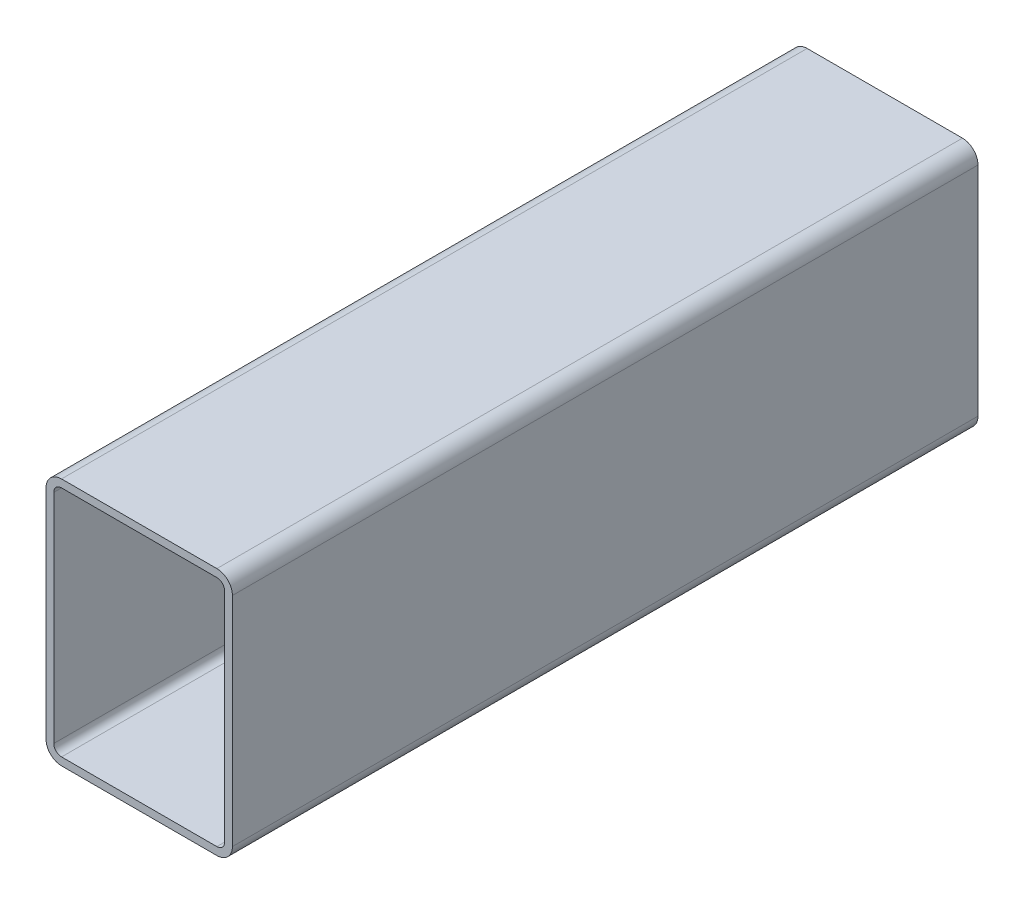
ISO-10303-21;
HEADER;
FILE_DESCRIPTION(('STEP AP214'),'2;1');
FILE_NAME('part.step','',(''),(''),'','','');
FILE_SCHEMA(('AUTOMOTIVE_DESIGN { 1 0 10303 214 1 1 1 1 }'));
ENDSEC;
DATA;
#1=APPLICATION_CONTEXT('core data for automotive mechanical design processes');
#2=APPLICATION_PROTOCOL_DEFINITION('international standard','automotive_design',2000,#1);
#3=PRODUCT_CONTEXT('',#1,'mechanical');
#4=PRODUCT('Part','Part','',(#3));
#5=PRODUCT_RELATED_PRODUCT_CATEGORY('part','',(#4));
#6=PRODUCT_DEFINITION_FORMATION('','',#4);
#7=PRODUCT_DEFINITION_CONTEXT('part definition',#1,'design');
#8=PRODUCT_DEFINITION('design','',#6,#7);
#9=PRODUCT_DEFINITION_SHAPE('','',#8);
#10=(LENGTH_UNIT() NAMED_UNIT(*) SI_UNIT(.MILLI.,.METRE.));
#11=(NAMED_UNIT(*) PLANE_ANGLE_UNIT() SI_UNIT($,.RADIAN.));
#12=(NAMED_UNIT(*) SI_UNIT($,.STERADIAN.) SOLID_ANGLE_UNIT());
#13=UNCERTAINTY_MEASURE_WITH_UNIT(LENGTH_MEASURE(1.E-05),#10,'distance_accuracy_value','');
#14=(GEOMETRIC_REPRESENTATION_CONTEXT(3) GLOBAL_UNCERTAINTY_ASSIGNED_CONTEXT((#13)) GLOBAL_UNIT_ASSIGNED_CONTEXT((#10,
#11,#12)) REPRESENTATION_CONTEXT('',''));
#15=CARTESIAN_POINT('',(0.,0.,0.));
#16=DIRECTION('',(0.,0.,1.));
#17=DIRECTION('',(1.,0.,0.));
#18=AXIS2_PLACEMENT_3D('',#15,#16,#17);
#19=CARTESIAN_POINT('',(8.83911603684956,97.3077651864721,304.8));
#20=DIRECTION('',(0.,0.,1.));
#21=DIRECTION('',(1.,0.,0.));
#22=AXIS2_PLACEMENT_3D('',#19,#20,#21);
#23=PLANE('',#22);
#24=CARTESIAN_POINT('',(8.83911603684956,97.3077651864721,304.8));
#25=DIRECTION('',(0.,0.,1.));
#26=DIRECTION('',(1.,0.,0.));
#27=AXIS2_PLACEMENT_3D('',#24,#25,#26);
#28=CIRCLE('',#27,6.35000000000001);
#29=CARTESIAN_POINT('',(8.83911603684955,103.657765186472,304.8));
#30=VERTEX_POINT('',#29);
#31=CARTESIAN_POINT('',(2.48911603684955,97.3077651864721,304.8));
#32=VERTEX_POINT('',#31);
#33=EDGE_CURVE('E211',#30,#32,#28,.T.);
#34=ORIENTED_EDGE('',*,*,#33,.T.);
#35=DIRECTION('',(0.,-1.,0.));
#36=VECTOR('',#35,1.);
#37=CARTESIAN_POINT('',(2.48911603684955,8.40776518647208,304.8));
#38=LINE('',#37,#36);
#39=CARTESIAN_POINT('',(2.48911603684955,8.40776518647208,304.8));
#40=VERTEX_POINT('',#39);
#41=EDGE_CURVE('E214',#32,#40,#38,.T.);
#42=ORIENTED_EDGE('',*,*,#41,.T.);
#43=CARTESIAN_POINT('',(8.83911603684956,8.40776518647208,304.8));
#44=DIRECTION('',(0.,0.,1.));
#45=DIRECTION('',(1.,0.,0.));
#46=AXIS2_PLACEMENT_3D('',#43,#44,#45);
#47=CIRCLE('',#46,6.35);
#48=CARTESIAN_POINT('',(8.83911603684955,2.05776518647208,304.8));
#49=VERTEX_POINT('',#48);
#50=EDGE_CURVE('E217',#40,#49,#47,.T.);
#51=ORIENTED_EDGE('',*,*,#50,.T.);
#52=DIRECTION('',(1.,0.,0.));
#53=VECTOR('',#52,1.);
#54=CARTESIAN_POINT('',(72.3391160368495,2.05776518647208,304.8));
#55=LINE('',#54,#53);
#56=CARTESIAN_POINT('',(72.3391160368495,2.05776518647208,304.8));
#57=VERTEX_POINT('',#56);
#58=EDGE_CURVE('E219',#49,#57,#55,.T.);
#59=ORIENTED_EDGE('',*,*,#58,.T.);
#60=CARTESIAN_POINT('',(72.3391160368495,8.40776518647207,304.8));
#61=DIRECTION('',(0.,0.,1.));
#62=DIRECTION('',(1.,0.,0.));
#63=AXIS2_PLACEMENT_3D('',#60,#61,#62);
#64=CIRCLE('',#63,6.35);
#65=CARTESIAN_POINT('',(78.6891160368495,8.40776518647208,304.8));
#66=VERTEX_POINT('',#65);
#67=EDGE_CURVE('E221',#57,#66,#64,.T.);
#68=ORIENTED_EDGE('',*,*,#67,.T.);
#69=DIRECTION('',(0.,1.,0.));
#70=VECTOR('',#69,1.);
#71=CARTESIAN_POINT('',(78.6891160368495,97.3077651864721,304.8));
#72=LINE('',#71,#70);
#73=CARTESIAN_POINT('',(78.6891160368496,97.3077651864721,304.8));
#74=VERTEX_POINT('',#73);
#75=EDGE_CURVE('E223',#66,#74,#72,.T.);
#76=ORIENTED_EDGE('',*,*,#75,.T.);
#77=CARTESIAN_POINT('',(72.3391160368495,97.3077651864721,304.8));
#78=DIRECTION('',(0.,0.,1.));
#79=DIRECTION('',(1.,0.,0.));
#80=AXIS2_PLACEMENT_3D('',#77,#78,#79);
#81=CIRCLE('',#80,6.35);
#82=CARTESIAN_POINT('',(72.3391160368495,103.657765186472,304.8));
#83=VERTEX_POINT('',#82);
#84=EDGE_CURVE('E225',#74,#83,#81,.T.);
#85=ORIENTED_EDGE('',*,*,#84,.T.);
#86=DIRECTION('',(-1.,0.,0.));
#87=VECTOR('',#86,1.);
#88=CARTESIAN_POINT('',(8.83911603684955,103.657765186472,304.8));
#89=LINE('',#88,#87);
#90=EDGE_CURVE('E227',#83,#30,#89,.T.);
#91=ORIENTED_EDGE('',*,*,#90,.T.);
#92=EDGE_LOOP('',(#34,#42,#51,#59,#68,#76,#85,#91));
#93=FACE_BOUND('',#92,.T.);
#94=DIRECTION('',(0.,-1.,0.));
#95=VECTOR('',#94,1.);
#96=CARTESIAN_POINT('',(5.66411603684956,8.40776518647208,304.8));
#97=LINE('',#96,#95);
#98=CARTESIAN_POINT('',(5.66411603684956,97.3077651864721,304.8));
#99=VERTEX_POINT('',#98);
#100=CARTESIAN_POINT('',(5.66411603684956,8.40776518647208,304.8));
#101=VERTEX_POINT('',#100);
#102=EDGE_CURVE('E154',#99,#101,#97,.T.);
#103=ORIENTED_EDGE('',*,*,#102,.F.);
#104=CARTESIAN_POINT('',(8.83911603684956,97.3077651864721,304.8));
#105=DIRECTION('',(0.,0.,1.));
#106=DIRECTION('',(1.,0.,0.));
#107=AXIS2_PLACEMENT_3D('',#104,#105,#106);
#108=CIRCLE('',#107,3.17500000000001);
#109=CARTESIAN_POINT('',(8.83911603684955,100.482765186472,304.8));
#110=VERTEX_POINT('',#109);
#111=EDGE_CURVE('E146',#110,#99,#108,.T.);
#112=ORIENTED_EDGE('',*,*,#111,.F.);
#113=DIRECTION('',(-1.,0.,0.));
#114=VECTOR('',#113,1.);
#115=CARTESIAN_POINT('',(8.83911603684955,100.482765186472,304.8));
#116=LINE('',#115,#114);
#117=CARTESIAN_POINT('',(72.3391160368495,100.482765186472,304.8));
#118=VERTEX_POINT('',#117);
#119=EDGE_CURVE('E179',#118,#110,#116,.T.);
#120=ORIENTED_EDGE('',*,*,#119,.F.);
#121=CARTESIAN_POINT('',(72.3391160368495,97.3077651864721,304.8));
#122=DIRECTION('',(0.,0.,1.));
#123=DIRECTION('',(1.,0.,0.));
#124=AXIS2_PLACEMENT_3D('',#121,#122,#123);
#125=CIRCLE('',#124,3.17500000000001);
#126=CARTESIAN_POINT('',(75.5141160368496,97.3077651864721,304.8));
#127=VERTEX_POINT('',#126);
#128=EDGE_CURVE('E177',#127,#118,#125,.T.);
#129=ORIENTED_EDGE('',*,*,#128,.F.);
#130=DIRECTION('',(0.,1.,0.));
#131=VECTOR('',#130,1.);
#132=CARTESIAN_POINT('',(75.5141160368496,97.3077651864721,304.8));
#133=LINE('',#132,#131);
#134=CARTESIAN_POINT('',(75.5141160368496,8.40776518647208,304.8));
#135=VERTEX_POINT('',#134);
#136=EDGE_CURVE('E175',#135,#127,#133,.T.);
#137=ORIENTED_EDGE('',*,*,#136,.F.);
#138=CARTESIAN_POINT('',(72.3391160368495,8.40776518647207,304.8));
#139=DIRECTION('',(0.,0.,1.));
#140=DIRECTION('',(1.,0.,0.));
#141=AXIS2_PLACEMENT_3D('',#138,#139,#140);
#142=CIRCLE('',#141,3.175);
#143=CARTESIAN_POINT('',(72.3391160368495,5.23276518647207,304.8));
#144=VERTEX_POINT('',#143);
#145=EDGE_CURVE('E173',#144,#135,#142,.T.);
#146=ORIENTED_EDGE('',*,*,#145,.F.);
#147=DIRECTION('',(1.,0.,0.));
#148=VECTOR('',#147,1.);
#149=CARTESIAN_POINT('',(72.3391160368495,5.23276518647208,304.8));
#150=LINE('',#149,#148);
#151=CARTESIAN_POINT('',(8.83911603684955,5.23276518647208,304.8));
#152=VERTEX_POINT('',#151);
#153=EDGE_CURVE('E169',#152,#144,#150,.T.);
#154=ORIENTED_EDGE('',*,*,#153,.F.);
#155=CARTESIAN_POINT('',(8.83911603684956,8.40776518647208,304.8));
#156=DIRECTION('',(0.,0.,1.));
#157=DIRECTION('',(1.,0.,0.));
#158=AXIS2_PLACEMENT_3D('',#155,#156,#157);
#159=CIRCLE('',#158,3.175);
#160=EDGE_CURVE('E167',#101,#152,#159,.T.);
#161=ORIENTED_EDGE('',*,*,#160,.F.);
#162=EDGE_LOOP('',(#103,#112,#120,#129,#137,#146,#154,#161));
#163=FACE_BOUND('',#162,.T.);
#164=ADVANCED_FACE('F33',(#93,#163),#23,.T.);
#165=CARTESIAN_POINT('',(8.83911603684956,97.3077651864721,0.));
#166=DIRECTION('',(0.,0.,1.));
#167=DIRECTION('',(1.,0.,0.));
#168=AXIS2_PLACEMENT_3D('',#165,#166,#167);
#169=PLANE('',#168);
#170=CARTESIAN_POINT('',(8.83911603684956,97.3077651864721,0.));
#171=DIRECTION('',(0.,0.,1.));
#172=DIRECTION('',(1.,0.,0.));
#173=AXIS2_PLACEMENT_3D('',#170,#171,#172);
#174=CIRCLE('',#173,6.35000000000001);
#175=CARTESIAN_POINT('',(8.83911603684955,103.657765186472,0.));
#176=VERTEX_POINT('',#175);
#177=CARTESIAN_POINT('',(2.48911603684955,97.3077651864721,0.));
#178=VERTEX_POINT('',#177);
#179=EDGE_CURVE('E162',#176,#178,#174,.T.);
#180=ORIENTED_EDGE('',*,*,#179,.F.);
#181=DIRECTION('',(-1.,0.,0.));
#182=VECTOR('',#181,1.);
#183=CARTESIAN_POINT('',(8.83911603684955,103.657765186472,0.));
#184=LINE('',#183,#182);
#185=CARTESIAN_POINT('',(72.3391160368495,103.657765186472,0.));
#186=VERTEX_POINT('',#185);
#187=EDGE_CURVE('E215',#186,#176,#184,.T.);
#188=ORIENTED_EDGE('',*,*,#187,.F.);
#189=CARTESIAN_POINT('',(72.3391160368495,97.3077651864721,0.));
#190=DIRECTION('',(0.,0.,1.));
#191=DIRECTION('',(1.,0.,0.));
#192=AXIS2_PLACEMENT_3D('',#189,#190,#191);
#193=CIRCLE('',#192,6.35);
#194=CARTESIAN_POINT('',(78.6891160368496,97.3077651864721,0.));
#195=VERTEX_POINT('',#194);
#196=EDGE_CURVE('E242',#195,#186,#193,.T.);
#197=ORIENTED_EDGE('',*,*,#196,.F.);
#198=DIRECTION('',(0.,1.,0.));
#199=VECTOR('',#198,1.);
#200=CARTESIAN_POINT('',(78.6891160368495,97.3077651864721,0.));
#201=LINE('',#200,#199);
#202=CARTESIAN_POINT('',(78.6891160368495,8.40776518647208,0.));
#203=VERTEX_POINT('',#202);
#204=EDGE_CURVE('E240',#203,#195,#201,.T.);
#205=ORIENTED_EDGE('',*,*,#204,.F.);
#206=CARTESIAN_POINT('',(72.3391160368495,8.40776518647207,0.));
#207=DIRECTION('',(0.,0.,1.));
#208=DIRECTION('',(1.,0.,0.));
#209=AXIS2_PLACEMENT_3D('',#206,#207,#208);
#210=CIRCLE('',#209,6.35);
#211=CARTESIAN_POINT('',(72.3391160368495,2.05776518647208,0.));
#212=VERTEX_POINT('',#211);
#213=EDGE_CURVE('E238',#212,#203,#210,.T.);
#214=ORIENTED_EDGE('',*,*,#213,.F.);
#215=DIRECTION('',(1.,0.,0.));
#216=VECTOR('',#215,1.);
#217=CARTESIAN_POINT('',(72.3391160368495,2.05776518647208,0.));
#218=LINE('',#217,#216);
#219=CARTESIAN_POINT('',(8.83911603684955,2.05776518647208,0.));
#220=VERTEX_POINT('',#219);
#221=EDGE_CURVE('E236',#220,#212,#218,.T.);
#222=ORIENTED_EDGE('',*,*,#221,.F.);
#223=CARTESIAN_POINT('',(8.83911603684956,8.40776518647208,0.));
#224=DIRECTION('',(0.,0.,1.));
#225=DIRECTION('',(1.,0.,0.));
#226=AXIS2_PLACEMENT_3D('',#223,#224,#225);
#227=CIRCLE('',#226,6.35);
#228=CARTESIAN_POINT('',(2.48911603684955,8.40776518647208,0.));
#229=VERTEX_POINT('',#228);
#230=EDGE_CURVE('E234',#229,#220,#227,.T.);
#231=ORIENTED_EDGE('',*,*,#230,.F.);
#232=DIRECTION('',(0.,-1.,0.));
#233=VECTOR('',#232,1.);
#234=CARTESIAN_POINT('',(2.48911603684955,8.40776518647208,0.));
#235=LINE('',#234,#233);
#236=EDGE_CURVE('E232',#178,#229,#235,.T.);
#237=ORIENTED_EDGE('',*,*,#236,.F.);
#238=EDGE_LOOP('',(#180,#188,#197,#205,#214,#222,#231,#237));
#239=FACE_BOUND('',#238,.T.);
#240=CARTESIAN_POINT('',(8.83911603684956,97.3077651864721,0.));
#241=DIRECTION('',(0.,0.,1.));
#242=DIRECTION('',(1.,0.,0.));
#243=AXIS2_PLACEMENT_3D('',#240,#241,#242);
#244=CIRCLE('',#243,3.17500000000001);
#245=CARTESIAN_POINT('',(8.83911603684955,100.482765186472,0.));
#246=VERTEX_POINT('',#245);
#247=CARTESIAN_POINT('',(5.66411603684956,97.3077651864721,0.));
#248=VERTEX_POINT('',#247);
#249=EDGE_CURVE('E56',#246,#248,#244,.T.);
#250=ORIENTED_EDGE('',*,*,#249,.T.);
#251=DIRECTION('',(0.,-1.,0.));
#252=VECTOR('',#251,1.);
#253=CARTESIAN_POINT('',(5.66411603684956,8.40776518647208,0.));
#254=LINE('',#253,#252);
#255=CARTESIAN_POINT('',(5.66411603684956,8.40776518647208,0.));
#256=VERTEX_POINT('',#255);
#257=EDGE_CURVE('E161',#248,#256,#254,.T.);
#258=ORIENTED_EDGE('',*,*,#257,.T.);
#259=CARTESIAN_POINT('',(8.83911603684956,8.40776518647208,0.));
#260=DIRECTION('',(0.,0.,1.));
#261=DIRECTION('',(1.,0.,0.));
#262=AXIS2_PLACEMENT_3D('',#259,#260,#261);
#263=CIRCLE('',#262,3.175);
#264=CARTESIAN_POINT('',(8.83911603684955,5.23276518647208,0.));
#265=VERTEX_POINT('',#264);
#266=EDGE_CURVE('E183',#256,#265,#263,.T.);
#267=ORIENTED_EDGE('',*,*,#266,.T.);
#268=DIRECTION('',(1.,0.,0.));
#269=VECTOR('',#268,1.);
#270=CARTESIAN_POINT('',(72.3391160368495,5.23276518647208,0.));
#271=LINE('',#270,#269);
#272=CARTESIAN_POINT('',(72.3391160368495,5.23276518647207,0.));
#273=VERTEX_POINT('',#272);
#274=EDGE_CURVE('E186',#265,#273,#271,.T.);
#275=ORIENTED_EDGE('',*,*,#274,.T.);
#276=CARTESIAN_POINT('',(72.3391160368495,8.40776518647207,0.));
#277=DIRECTION('',(0.,0.,1.));
#278=DIRECTION('',(1.,0.,0.));
#279=AXIS2_PLACEMENT_3D('',#276,#277,#278);
#280=CIRCLE('',#279,3.175);
#281=CARTESIAN_POINT('',(75.5141160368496,8.40776518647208,0.));
#282=VERTEX_POINT('',#281);
#283=EDGE_CURVE('E189',#273,#282,#280,.T.);
#284=ORIENTED_EDGE('',*,*,#283,.T.);
#285=DIRECTION('',(0.,1.,0.));
#286=VECTOR('',#285,1.);
#287=CARTESIAN_POINT('',(75.5141160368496,97.3077651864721,0.));
#288=LINE('',#287,#286);
#289=CARTESIAN_POINT('',(75.5141160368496,97.3077651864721,0.));
#290=VERTEX_POINT('',#289);
#291=EDGE_CURVE('E192',#282,#290,#288,.T.);
#292=ORIENTED_EDGE('',*,*,#291,.T.);
#293=CARTESIAN_POINT('',(72.3391160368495,97.3077651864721,0.));
#294=DIRECTION('',(0.,0.,1.));
#295=DIRECTION('',(1.,0.,0.));
#296=AXIS2_PLACEMENT_3D('',#293,#294,#295);
#297=CIRCLE('',#296,3.17500000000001);
#298=CARTESIAN_POINT('',(72.3391160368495,100.482765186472,0.));
#299=VERTEX_POINT('',#298);
#300=EDGE_CURVE('E195',#290,#299,#297,.T.);
#301=ORIENTED_EDGE('',*,*,#300,.T.);
#302=DIRECTION('',(-1.,0.,0.));
#303=VECTOR('',#302,1.);
#304=CARTESIAN_POINT('',(8.83911603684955,100.482765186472,0.));
#305=LINE('',#304,#303);
#306=EDGE_CURVE('E155',#299,#246,#305,.T.);
#307=ORIENTED_EDGE('',*,*,#306,.T.);
#308=EDGE_LOOP('',(#250,#258,#267,#275,#284,#292,#301,#307));
#309=FACE_BOUND('',#308,.T.);
#310=ADVANCED_FACE('F272',(#239,#309),#169,.F.);
#311=CARTESIAN_POINT('',(8.83911603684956,97.3077651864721,304.8));
#312=DIRECTION('',(0.,0.,-1.));
#313=DIRECTION('',(-1.,0.,0.));
#314=AXIS2_PLACEMENT_3D('',#311,#312,#313);
#315=CYLINDRICAL_SURFACE('',#314,6.35000000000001);
#316=ORIENTED_EDGE('',*,*,#179,.T.);
#317=DIRECTION('',(0.,0.,-1.));
#318=VECTOR('',#317,1.);
#319=CARTESIAN_POINT('',(2.48911603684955,97.3077651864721,304.8));
#320=LINE('',#319,#318);
#321=EDGE_CURVE('E11',#32,#178,#320,.T.);
#322=ORIENTED_EDGE('',*,*,#321,.F.);
#323=ORIENTED_EDGE('',*,*,#33,.F.);
#324=DIRECTION('',(0.,0.,-1.));
#325=VECTOR('',#324,1.);
#326=CARTESIAN_POINT('',(8.83911603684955,103.657765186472,304.8));
#327=LINE('',#326,#325);
#328=EDGE_CURVE('E229',#30,#176,#327,.T.);
#329=ORIENTED_EDGE('',*,*,#328,.T.);
#330=EDGE_LOOP('',(#316,#322,#323,#329));
#331=FACE_BOUND('',#330,.T.);
#332=ADVANCED_FACE('F35',(#331),#315,.T.);
#333=CARTESIAN_POINT('',(2.48911603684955,8.40776518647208,304.8));
#334=DIRECTION('',(1.,0.,0.));
#335=DIRECTION('',(0.,0.,-1.));
#336=AXIS2_PLACEMENT_3D('',#333,#334,#335);
#337=PLANE('',#336);
#338=ORIENTED_EDGE('',*,*,#236,.T.);
#339=DIRECTION('',(0.,0.,-1.));
#340=VECTOR('',#339,1.);
#341=CARTESIAN_POINT('',(2.48911603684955,8.40776518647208,304.8));
#342=LINE('',#341,#340);
#343=EDGE_CURVE('E41',#40,#229,#342,.T.);
#344=ORIENTED_EDGE('',*,*,#343,.F.);
#345=ORIENTED_EDGE('',*,*,#41,.F.);
#346=ORIENTED_EDGE('',*,*,#321,.T.);
#347=EDGE_LOOP('',(#338,#344,#345,#346));
#348=FACE_BOUND('',#347,.T.);
#349=ADVANCED_FACE('F289',(#348),#337,.F.);
#350=CARTESIAN_POINT('',(8.83911603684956,8.40776518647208,304.8));
#351=DIRECTION('',(0.,0.,-1.));
#352=DIRECTION('',(-1.,0.,0.));
#353=AXIS2_PLACEMENT_3D('',#350,#351,#352);
#354=CYLINDRICAL_SURFACE('',#353,6.35);
#355=ORIENTED_EDGE('',*,*,#230,.T.);
#356=DIRECTION('',(0.,0.,-1.));
#357=VECTOR('',#356,1.);
#358=CARTESIAN_POINT('',(8.83911603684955,2.05776518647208,304.8));
#359=LINE('',#358,#357);
#360=EDGE_CURVE('E259',#49,#220,#359,.T.);
#361=ORIENTED_EDGE('',*,*,#360,.F.);
#362=ORIENTED_EDGE('',*,*,#50,.F.);
#363=ORIENTED_EDGE('',*,*,#343,.T.);
#364=EDGE_LOOP('',(#355,#361,#362,#363));
#365=FACE_BOUND('',#364,.T.);
#366=ADVANCED_FACE('F266',(#365),#354,.T.);
#367=CARTESIAN_POINT('',(72.3391160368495,2.05776518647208,304.8));
#368=DIRECTION('',(0.,1.,0.));
#369=DIRECTION('',(0.,0.,1.));
#370=AXIS2_PLACEMENT_3D('',#367,#368,#369);
#371=PLANE('',#370);
#372=ORIENTED_EDGE('',*,*,#221,.T.);
#373=DIRECTION('',(0.,0.,-1.));
#374=VECTOR('',#373,1.);
#375=CARTESIAN_POINT('',(72.3391160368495,2.05776518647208,304.8));
#376=LINE('',#375,#374);
#377=EDGE_CURVE('E256',#57,#212,#376,.T.);
#378=ORIENTED_EDGE('',*,*,#377,.F.);
#379=ORIENTED_EDGE('',*,*,#58,.F.);
#380=ORIENTED_EDGE('',*,*,#360,.T.);
#381=EDGE_LOOP('',(#372,#378,#379,#380));
#382=FACE_BOUND('',#381,.T.);
#383=ADVANCED_FACE('F278',(#382),#371,.F.);
#384=CARTESIAN_POINT('',(72.3391160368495,8.40776518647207,304.8));
#385=DIRECTION('',(0.,0.,-1.));
#386=DIRECTION('',(-1.,0.,0.));
#387=AXIS2_PLACEMENT_3D('',#384,#385,#386);
#388=CYLINDRICAL_SURFACE('',#387,6.35);
#389=ORIENTED_EDGE('',*,*,#213,.T.);
#390=DIRECTION('',(0.,0.,-1.));
#391=VECTOR('',#390,1.);
#392=CARTESIAN_POINT('',(78.6891160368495,8.40776518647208,304.8));
#393=LINE('',#392,#391);
#394=EDGE_CURVE('E253',#66,#203,#393,.T.);
#395=ORIENTED_EDGE('',*,*,#394,.F.);
#396=ORIENTED_EDGE('',*,*,#67,.F.);
#397=ORIENTED_EDGE('',*,*,#377,.T.);
#398=EDGE_LOOP('',(#389,#395,#396,#397));
#399=FACE_BOUND('',#398,.T.);
#400=ADVANCED_FACE('F282',(#399),#388,.T.);
#401=CARTESIAN_POINT('',(78.6891160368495,97.3077651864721,304.8));
#402=DIRECTION('',(-1.,0.,0.));
#403=DIRECTION('',(0.,0.,1.));
#404=AXIS2_PLACEMENT_3D('',#401,#402,#403);
#405=PLANE('',#404);
#406=ORIENTED_EDGE('',*,*,#204,.T.);
#407=DIRECTION('',(0.,0.,-1.));
#408=VECTOR('',#407,1.);
#409=CARTESIAN_POINT('',(78.6891160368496,97.3077651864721,304.8));
#410=LINE('',#409,#408);
#411=EDGE_CURVE('E250',#74,#195,#410,.T.);
#412=ORIENTED_EDGE('',*,*,#411,.F.);
#413=ORIENTED_EDGE('',*,*,#75,.F.);
#414=ORIENTED_EDGE('',*,*,#394,.T.);
#415=EDGE_LOOP('',(#406,#412,#413,#414));
#416=FACE_BOUND('',#415,.T.);
#417=ADVANCED_FACE('F302',(#416),#405,.F.);
#418=CARTESIAN_POINT('',(72.3391160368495,97.3077651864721,304.8));
#419=DIRECTION('',(0.,0.,-1.));
#420=DIRECTION('',(-1.,0.,0.));
#421=AXIS2_PLACEMENT_3D('',#418,#419,#420);
#422=CYLINDRICAL_SURFACE('',#421,6.35);
#423=ORIENTED_EDGE('',*,*,#196,.T.);
#424=DIRECTION('',(0.,0.,-1.));
#425=VECTOR('',#424,1.);
#426=CARTESIAN_POINT('',(72.3391160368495,103.657765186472,304.8));
#427=LINE('',#426,#425);
#428=EDGE_CURVE('E247',#83,#186,#427,.T.);
#429=ORIENTED_EDGE('',*,*,#428,.F.);
#430=ORIENTED_EDGE('',*,*,#84,.F.);
#431=ORIENTED_EDGE('',*,*,#411,.T.);
#432=EDGE_LOOP('',(#423,#429,#430,#431));
#433=FACE_BOUND('',#432,.T.);
#434=ADVANCED_FACE('F300',(#433),#422,.T.);
#435=CARTESIAN_POINT('',(8.83911603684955,103.657765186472,304.8));
#436=DIRECTION('',(0.,-1.,0.));
#437=DIRECTION('',(0.,0.,-1.));
#438=AXIS2_PLACEMENT_3D('',#435,#436,#437);
#439=PLANE('',#438);
#440=ORIENTED_EDGE('',*,*,#187,.T.);
#441=ORIENTED_EDGE('',*,*,#328,.F.);
#442=ORIENTED_EDGE('',*,*,#90,.F.);
#443=ORIENTED_EDGE('',*,*,#428,.T.);
#444=EDGE_LOOP('',(#440,#441,#442,#443));
#445=FACE_BOUND('',#444,.T.);
#446=ADVANCED_FACE('F295',(#445),#439,.F.);
#447=CARTESIAN_POINT('',(8.83911603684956,97.3077651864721,304.8));
#448=DIRECTION('',(0.,0.,-1.));
#449=DIRECTION('',(-1.,0.,0.));
#450=AXIS2_PLACEMENT_3D('',#447,#448,#449);
#451=CYLINDRICAL_SURFACE('',#450,3.17500000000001);
#452=ORIENTED_EDGE('',*,*,#249,.F.);
#453=DIRECTION('',(0.,0.,-1.));
#454=VECTOR('',#453,1.);
#455=CARTESIAN_POINT('',(8.83911603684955,100.482765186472,304.8));
#456=LINE('',#455,#454);
#457=EDGE_CURVE('E150',#110,#246,#456,.T.);
#458=ORIENTED_EDGE('',*,*,#457,.F.);
#459=ORIENTED_EDGE('',*,*,#111,.T.);
#460=DIRECTION('',(0.,0.,-1.));
#461=VECTOR('',#460,1.);
#462=CARTESIAN_POINT('',(5.66411603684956,97.3077651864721,304.8));
#463=LINE('',#462,#461);
#464=EDGE_CURVE('E149',#99,#248,#463,.T.);
#465=ORIENTED_EDGE('',*,*,#464,.T.);
#466=EDGE_LOOP('',(#452,#458,#459,#465));
#467=FACE_BOUND('',#466,.T.);
#468=ADVANCED_FACE('F148',(#467),#451,.F.);
#469=CARTESIAN_POINT('',(5.66411603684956,8.40776518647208,304.8));
#470=DIRECTION('',(1.,0.,0.));
#471=DIRECTION('',(0.,0.,-1.));
#472=AXIS2_PLACEMENT_3D('',#469,#470,#471);
#473=PLANE('',#472);
#474=ORIENTED_EDGE('',*,*,#257,.F.);
#475=ORIENTED_EDGE('',*,*,#464,.F.);
#476=ORIENTED_EDGE('',*,*,#102,.T.);
#477=DIRECTION('',(0.,0.,-1.));
#478=VECTOR('',#477,1.);
#479=CARTESIAN_POINT('',(5.66411603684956,8.40776518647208,304.8));
#480=LINE('',#479,#478);
#481=EDGE_CURVE('E163',#101,#256,#480,.T.);
#482=ORIENTED_EDGE('',*,*,#481,.T.);
#483=EDGE_LOOP('',(#474,#475,#476,#482));
#484=FACE_BOUND('',#483,.T.);
#485=ADVANCED_FACE('F158',(#484),#473,.T.);
#486=CARTESIAN_POINT('',(8.83911603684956,8.40776518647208,304.8));
#487=DIRECTION('',(0.,0.,-1.));
#488=DIRECTION('',(-1.,0.,0.));
#489=AXIS2_PLACEMENT_3D('',#486,#487,#488);
#490=CYLINDRICAL_SURFACE('',#489,3.175);
#491=ORIENTED_EDGE('',*,*,#266,.F.);
#492=ORIENTED_EDGE('',*,*,#481,.F.);
#493=ORIENTED_EDGE('',*,*,#160,.T.);
#494=DIRECTION('',(0.,0.,-1.));
#495=VECTOR('',#494,1.);
#496=CARTESIAN_POINT('',(8.83911603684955,5.23276518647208,304.8));
#497=LINE('',#496,#495);
#498=EDGE_CURVE('E208',#152,#265,#497,.T.);
#499=ORIENTED_EDGE('',*,*,#498,.T.);
#500=EDGE_LOOP('',(#491,#492,#493,#499));
#501=FACE_BOUND('',#500,.T.);
#502=ADVANCED_FACE('F327',(#501),#490,.F.);
#503=CARTESIAN_POINT('',(72.3391160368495,5.23276518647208,304.8));
#504=DIRECTION('',(0.,1.,0.));
#505=DIRECTION('',(0.,0.,1.));
#506=AXIS2_PLACEMENT_3D('',#503,#504,#505);
#507=PLANE('',#506);
#508=ORIENTED_EDGE('',*,*,#274,.F.);
#509=ORIENTED_EDGE('',*,*,#498,.F.);
#510=ORIENTED_EDGE('',*,*,#153,.T.);
#511=DIRECTION('',(0.,0.,-1.));
#512=VECTOR('',#511,1.);
#513=CARTESIAN_POINT('',(72.3391160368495,5.23276518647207,304.8));
#514=LINE('',#513,#512);
#515=EDGE_CURVE('E206',#144,#273,#514,.T.);
#516=ORIENTED_EDGE('',*,*,#515,.T.);
#517=EDGE_LOOP('',(#508,#509,#510,#516));
#518=FACE_BOUND('',#517,.T.);
#519=ADVANCED_FACE('F331',(#518),#507,.T.);
#520=CARTESIAN_POINT('',(72.3391160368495,8.40776518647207,304.8));
#521=DIRECTION('',(0.,0.,-1.));
#522=DIRECTION('',(-1.,0.,0.));
#523=AXIS2_PLACEMENT_3D('',#520,#521,#522);
#524=CYLINDRICAL_SURFACE('',#523,3.175);
#525=ORIENTED_EDGE('',*,*,#283,.F.);
#526=ORIENTED_EDGE('',*,*,#515,.F.);
#527=ORIENTED_EDGE('',*,*,#145,.T.);
#528=DIRECTION('',(0.,0.,-1.));
#529=VECTOR('',#528,1.);
#530=CARTESIAN_POINT('',(75.5141160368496,8.40776518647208,304.8));
#531=LINE('',#530,#529);
#532=EDGE_CURVE('E204',#135,#282,#531,.T.);
#533=ORIENTED_EDGE('',*,*,#532,.T.);
#534=EDGE_LOOP('',(#525,#526,#527,#533));
#535=FACE_BOUND('',#534,.T.);
#536=ADVANCED_FACE('F337',(#535),#524,.F.);
#537=CARTESIAN_POINT('',(75.5141160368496,97.3077651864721,304.8));
#538=DIRECTION('',(-1.,0.,0.));
#539=DIRECTION('',(0.,0.,1.));
#540=AXIS2_PLACEMENT_3D('',#537,#538,#539);
#541=PLANE('',#540);
#542=ORIENTED_EDGE('',*,*,#291,.F.);
#543=ORIENTED_EDGE('',*,*,#532,.F.);
#544=ORIENTED_EDGE('',*,*,#136,.T.);
#545=DIRECTION('',(0.,0.,-1.));
#546=VECTOR('',#545,1.);
#547=CARTESIAN_POINT('',(75.5141160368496,97.3077651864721,304.8));
#548=LINE('',#547,#546);
#549=EDGE_CURVE('E202',#127,#290,#548,.T.);
#550=ORIENTED_EDGE('',*,*,#549,.T.);
#551=EDGE_LOOP('',(#542,#543,#544,#550));
#552=FACE_BOUND('',#551,.T.);
#553=ADVANCED_FACE('F341',(#552),#541,.T.);
#554=CARTESIAN_POINT('',(72.3391160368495,97.3077651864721,304.8));
#555=DIRECTION('',(0.,0.,-1.));
#556=DIRECTION('',(-1.,0.,0.));
#557=AXIS2_PLACEMENT_3D('',#554,#555,#556);
#558=CYLINDRICAL_SURFACE('',#557,3.17500000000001);
#559=ORIENTED_EDGE('',*,*,#300,.F.);
#560=ORIENTED_EDGE('',*,*,#549,.F.);
#561=ORIENTED_EDGE('',*,*,#128,.T.);
#562=DIRECTION('',(0.,0.,-1.));
#563=VECTOR('',#562,1.);
#564=CARTESIAN_POINT('',(72.3391160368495,100.482765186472,304.8));
#565=LINE('',#564,#563);
#566=EDGE_CURVE('E48',#118,#299,#565,.T.);
#567=ORIENTED_EDGE('',*,*,#566,.T.);
#568=EDGE_LOOP('',(#559,#560,#561,#567));
#569=FACE_BOUND('',#568,.T.);
#570=ADVANCED_FACE('F345',(#569),#558,.F.);
#571=CARTESIAN_POINT('',(8.83911603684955,100.482765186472,304.8));
#572=DIRECTION('',(0.,-1.,0.));
#573=DIRECTION('',(0.,0.,-1.));
#574=AXIS2_PLACEMENT_3D('',#571,#572,#573);
#575=PLANE('',#574);
#576=ORIENTED_EDGE('',*,*,#306,.F.);
#577=ORIENTED_EDGE('',*,*,#566,.F.);
#578=ORIENTED_EDGE('',*,*,#119,.T.);
#579=ORIENTED_EDGE('',*,*,#457,.T.);
#580=EDGE_LOOP('',(#576,#577,#578,#579));
#581=FACE_BOUND('',#580,.T.);
#582=ADVANCED_FACE('F349',(#581),#575,.T.);
#583=CLOSED_SHELL('',(#164,#310,#332,#349,#366,#383,#400,#417,#434,#446,#468,#485,#502,#519,
#536,#553,#570,#582));
#584=MANIFOLD_SOLID_BREP('B2',#583);
#585=ADVANCED_BREP_SHAPE_REPRESENTATION('',(#18,#584),#14);
#586=SHAPE_DEFINITION_REPRESENTATION(#9,#585);
ENDSEC;
END-ISO-10303-21;
